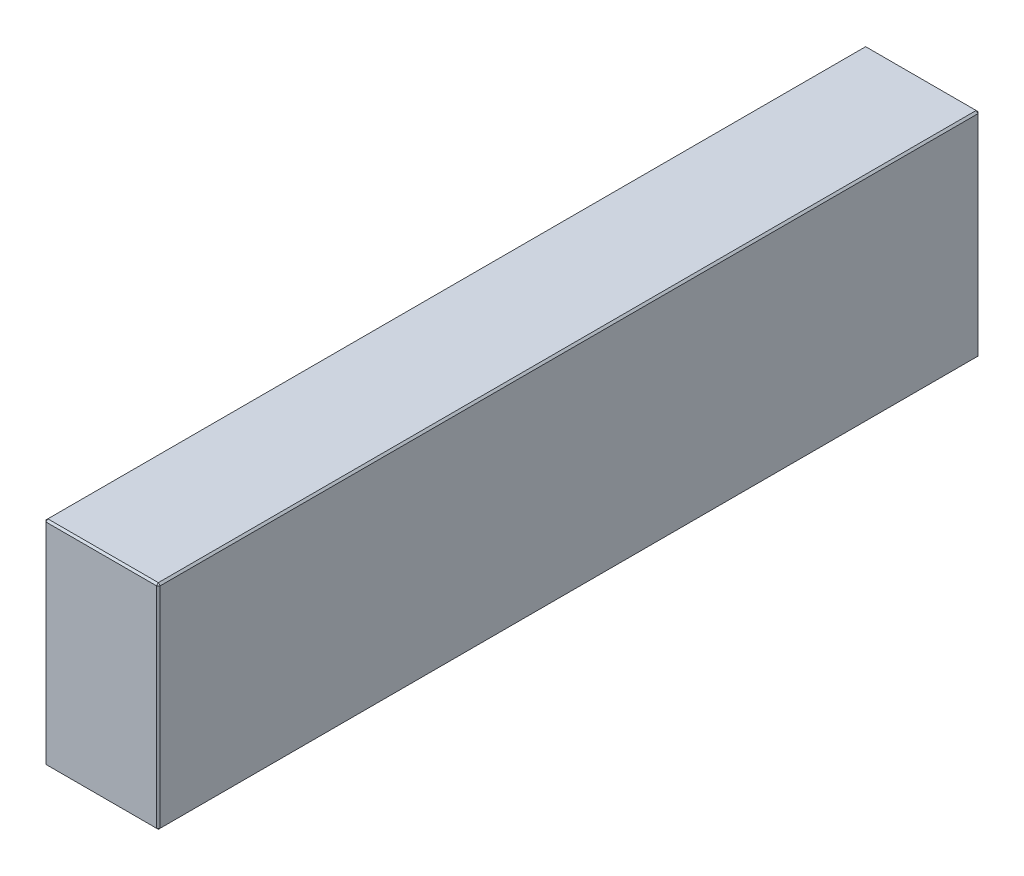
ISO-10303-21;
HEADER;
FILE_DESCRIPTION(('STEP AP214'),'2;1');
FILE_NAME('part.step','',(''),(''),'','','');
FILE_SCHEMA(('AUTOMOTIVE_DESIGN { 1 0 10303 214 1 1 1 1 }'));
ENDSEC;
DATA;
#1=APPLICATION_CONTEXT('core data for automotive mechanical design processes');
#2=APPLICATION_PROTOCOL_DEFINITION('international standard','automotive_design',2000,#1);
#3=PRODUCT_CONTEXT('',#1,'mechanical');
#4=PRODUCT('Part','Part','',(#3));
#5=PRODUCT_RELATED_PRODUCT_CATEGORY('part','',(#4));
#6=PRODUCT_DEFINITION_FORMATION('','',#4);
#7=PRODUCT_DEFINITION_CONTEXT('part definition',#1,'design');
#8=PRODUCT_DEFINITION('design','',#6,#7);
#9=PRODUCT_DEFINITION_SHAPE('','',#8);
#10=(LENGTH_UNIT() NAMED_UNIT(*) SI_UNIT(.MILLI.,.METRE.));
#11=(NAMED_UNIT(*) PLANE_ANGLE_UNIT() SI_UNIT($,.RADIAN.));
#12=(NAMED_UNIT(*) SI_UNIT($,.STERADIAN.) SOLID_ANGLE_UNIT());
#13=UNCERTAINTY_MEASURE_WITH_UNIT(LENGTH_MEASURE(1.E-05),#10,'distance_accuracy_value','');
#14=(GEOMETRIC_REPRESENTATION_CONTEXT(3) GLOBAL_UNCERTAINTY_ASSIGNED_CONTEXT((#13)) GLOBAL_UNIT_ASSIGNED_CONTEXT((#10,
#11,#12)) REPRESENTATION_CONTEXT('',''));
#15=CARTESIAN_POINT('',(0.,0.,0.));
#16=DIRECTION('',(0.,0.,1.));
#17=DIRECTION('',(1.,0.,0.));
#18=AXIS2_PLACEMENT_3D('',#15,#16,#17);
#19=CARTESIAN_POINT('',(-31.,116.,223.));
#20=DIRECTION('',(1.,0.,0.));
#21=DIRECTION('',(0.,0.,-1.));
#22=AXIS2_PLACEMENT_3D('',#19,#20,#21);
#23=PLANE('',#22);
#24=DIRECTION('',(0.,-1.,0.));
#25=VECTOR('',#24,1.);
#26=CARTESIAN_POINT('',(-31.,116.,-222.));
#27=LINE('',#26,#25);
#28=CARTESIAN_POINT('',(-31.,115.,-222.));
#29=VERTEX_POINT('',#28);
#30=CARTESIAN_POINT('',(-31.,1.,-222.));
#31=VERTEX_POINT('',#30);
#32=EDGE_CURVE('E114',#29,#31,#27,.T.);
#33=ORIENTED_EDGE('',*,*,#32,.T.);
#34=DIRECTION('',(0.,0.,1.));
#35=VECTOR('',#34,1.);
#36=CARTESIAN_POINT('',(-31.,1.,223.));
#37=LINE('',#36,#35);
#38=CARTESIAN_POINT('',(-31.,1.,222.));
#39=VERTEX_POINT('',#38);
#40=EDGE_CURVE('E110',#31,#39,#37,.T.);
#41=ORIENTED_EDGE('',*,*,#40,.T.);
#42=DIRECTION('',(0.,1.,0.));
#43=VECTOR('',#42,1.);
#44=CARTESIAN_POINT('',(-31.,116.,222.));
#45=LINE('',#44,#43);
#46=CARTESIAN_POINT('',(-31.,115.,222.));
#47=VERTEX_POINT('',#46);
#48=EDGE_CURVE('E103',#39,#47,#45,.T.);
#49=ORIENTED_EDGE('',*,*,#48,.T.);
#50=DIRECTION('',(0.,0.,-1.));
#51=VECTOR('',#50,1.);
#52=CARTESIAN_POINT('',(-31.,115.,-223.));
#53=LINE('',#52,#51);
#54=EDGE_CURVE('E107',#47,#29,#53,.T.);
#55=ORIENTED_EDGE('',*,*,#54,.T.);
#56=EDGE_LOOP('',(#33,#41,#49,#55));
#57=FACE_BOUND('',#56,.T.);
#58=ADVANCED_FACE('F15',(#57),#23,.F.);
#59=CARTESIAN_POINT('',(31.,116.,223.));
#60=DIRECTION('',(0.,0.,-1.));
#61=DIRECTION('',(-1.,0.,0.));
#62=AXIS2_PLACEMENT_3D('',#59,#60,#61);
#63=PLANE('',#62);
#64=DIRECTION('',(-1.,0.,0.));
#65=VECTOR('',#64,1.);
#66=CARTESIAN_POINT('',(-31.,115.,223.));
#67=LINE('',#66,#65);
#68=CARTESIAN_POINT('',(30.,115.,223.));
#69=VERTEX_POINT('',#68);
#70=CARTESIAN_POINT('',(-30.,115.,223.));
#71=VERTEX_POINT('',#70);
#72=EDGE_CURVE('E164',#69,#71,#67,.T.);
#73=ORIENTED_EDGE('',*,*,#72,.T.);
#74=DIRECTION('',(0.,-1.,0.));
#75=VECTOR('',#74,1.);
#76=CARTESIAN_POINT('',(-30.,116.,223.));
#77=LINE('',#76,#75);
#78=CARTESIAN_POINT('',(-30.,1.00000000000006,223.));
#79=VERTEX_POINT('',#78);
#80=EDGE_CURVE('E122',#71,#79,#77,.T.);
#81=ORIENTED_EDGE('',*,*,#80,.T.);
#82=DIRECTION('',(1.,0.,0.));
#83=VECTOR('',#82,1.);
#84=CARTESIAN_POINT('',(31.,1.00000000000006,223.));
#85=LINE('',#84,#83);
#86=CARTESIAN_POINT('',(30.,1.00000000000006,223.));
#87=VERTEX_POINT('',#86);
#88=EDGE_CURVE('E168',#79,#87,#85,.T.);
#89=ORIENTED_EDGE('',*,*,#88,.T.);
#90=DIRECTION('',(0.,1.,0.));
#91=VECTOR('',#90,1.);
#92=CARTESIAN_POINT('',(30.,116.,223.));
#93=LINE('',#92,#91);
#94=EDGE_CURVE('E166',#87,#69,#93,.T.);
#95=ORIENTED_EDGE('',*,*,#94,.T.);
#96=EDGE_LOOP('',(#73,#81,#89,#95));
#97=FACE_BOUND('',#96,.T.);
#98=ADVANCED_FACE('F275',(#97),#63,.F.);
#99=CARTESIAN_POINT('',(31.,116.,223.));
#100=DIRECTION('',(-1.,0.,0.));
#101=DIRECTION('',(0.,0.,1.));
#102=AXIS2_PLACEMENT_3D('',#99,#100,#101);
#103=PLANE('',#102);
#104=DIRECTION('',(0.,0.,-1.));
#105=VECTOR('',#104,1.);
#106=CARTESIAN_POINT('',(31.,1.00000000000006,223.));
#107=LINE('',#106,#105);
#108=CARTESIAN_POINT('',(31.,1.00000000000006,222.));
#109=VERTEX_POINT('',#108);
#110=CARTESIAN_POINT('',(31.,1.00000000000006,-222.));
#111=VERTEX_POINT('',#110);
#112=EDGE_CURVE('E159',#109,#111,#107,.T.);
#113=ORIENTED_EDGE('',*,*,#112,.T.);
#114=DIRECTION('',(0.,1.,0.));
#115=VECTOR('',#114,1.);
#116=CARTESIAN_POINT('',(31.,116.,-222.));
#117=LINE('',#116,#115);
#118=CARTESIAN_POINT('',(31.,115.,-222.));
#119=VERTEX_POINT('',#118);
#120=EDGE_CURVE('E161',#111,#119,#117,.T.);
#121=ORIENTED_EDGE('',*,*,#120,.T.);
#122=DIRECTION('',(0.,0.,1.));
#123=VECTOR('',#122,1.);
#124=CARTESIAN_POINT('',(31.,115.,223.));
#125=LINE('',#124,#123);
#126=CARTESIAN_POINT('',(31.,115.,222.));
#127=VERTEX_POINT('',#126);
#128=EDGE_CURVE('E155',#119,#127,#125,.T.);
#129=ORIENTED_EDGE('',*,*,#128,.T.);
#130=DIRECTION('',(0.,-1.,0.));
#131=VECTOR('',#130,1.);
#132=CARTESIAN_POINT('',(31.,116.,222.));
#133=LINE('',#132,#131);
#134=EDGE_CURVE('E157',#127,#109,#133,.T.);
#135=ORIENTED_EDGE('',*,*,#134,.T.);
#136=EDGE_LOOP('',(#113,#121,#129,#135));
#137=FACE_BOUND('',#136,.T.);
#138=ADVANCED_FACE('F254',(#137),#103,.F.);
#139=CARTESIAN_POINT('',(31.,116.,-223.));
#140=DIRECTION('',(0.,0.,1.));
#141=DIRECTION('',(1.,0.,0.));
#142=AXIS2_PLACEMENT_3D('',#139,#140,#141);
#143=PLANE('',#142);
#144=DIRECTION('',(0.,-1.,0.));
#145=VECTOR('',#144,1.);
#146=CARTESIAN_POINT('',(30.,116.,-223.));
#147=LINE('',#146,#145);
#148=CARTESIAN_POINT('',(30.,115.,-223.));
#149=VERTEX_POINT('',#148);
#150=CARTESIAN_POINT('',(30.,1.00000000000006,-223.));
#151=VERTEX_POINT('',#150);
#152=EDGE_CURVE('E148',#149,#151,#147,.T.);
#153=ORIENTED_EDGE('',*,*,#152,.T.);
#154=DIRECTION('',(-1.,0.,0.));
#155=VECTOR('',#154,1.);
#156=CARTESIAN_POINT('',(31.,1.00000000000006,-223.));
#157=LINE('',#156,#155);
#158=CARTESIAN_POINT('',(-30.,1.00000000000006,-223.));
#159=VERTEX_POINT('',#158);
#160=EDGE_CURVE('E153',#151,#159,#157,.T.);
#161=ORIENTED_EDGE('',*,*,#160,.T.);
#162=DIRECTION('',(0.,1.,0.));
#163=VECTOR('',#162,1.);
#164=CARTESIAN_POINT('',(-30.,116.,-223.));
#165=LINE('',#164,#163);
#166=CARTESIAN_POINT('',(-30.,115.,-223.));
#167=VERTEX_POINT('',#166);
#168=EDGE_CURVE('E150',#159,#167,#165,.T.);
#169=ORIENTED_EDGE('',*,*,#168,.T.);
#170=DIRECTION('',(1.,0.,0.));
#171=VECTOR('',#170,1.);
#172=CARTESIAN_POINT('',(31.,115.,-223.));
#173=LINE('',#172,#171);
#174=EDGE_CURVE('E146',#167,#149,#173,.T.);
#175=ORIENTED_EDGE('',*,*,#174,.T.);
#176=EDGE_LOOP('',(#153,#161,#169,#175));
#177=FACE_BOUND('',#176,.T.);
#178=ADVANCED_FACE('F284',(#177),#143,.F.);
#179=CARTESIAN_POINT('',(0.,116.,0.));
#180=DIRECTION('',(0.,1.,0.));
#181=DIRECTION('',(0.,0.,1.));
#182=AXIS2_PLACEMENT_3D('',#179,#180,#181);
#183=PLANE('',#182);
#184=DIRECTION('',(0.,0.,-1.));
#185=VECTOR('',#184,1.);
#186=CARTESIAN_POINT('',(30.,116.,-223.));
#187=LINE('',#186,#185);
#188=CARTESIAN_POINT('',(30.,116.,222.));
#189=VERTEX_POINT('',#188);
#190=CARTESIAN_POINT('',(30.,116.,-222.));
#191=VERTEX_POINT('',#190);
#192=EDGE_CURVE('E24',#189,#191,#187,.T.);
#193=ORIENTED_EDGE('',*,*,#192,.T.);
#194=DIRECTION('',(-1.,0.,0.));
#195=VECTOR('',#194,1.);
#196=CARTESIAN_POINT('',(-31.,116.,-222.));
#197=LINE('',#196,#195);
#198=CARTESIAN_POINT('',(-30.,116.,-222.));
#199=VERTEX_POINT('',#198);
#200=EDGE_CURVE('E9',#191,#199,#197,.T.);
#201=ORIENTED_EDGE('',*,*,#200,.T.);
#202=DIRECTION('',(0.,0.,1.));
#203=VECTOR('',#202,1.);
#204=CARTESIAN_POINT('',(-30.,116.,223.));
#205=LINE('',#204,#203);
#206=CARTESIAN_POINT('',(-30.,116.,222.));
#207=VERTEX_POINT('',#206);
#208=EDGE_CURVE('E180',#199,#207,#205,.T.);
#209=ORIENTED_EDGE('',*,*,#208,.T.);
#210=DIRECTION('',(1.,0.,0.));
#211=VECTOR('',#210,1.);
#212=CARTESIAN_POINT('',(31.,116.,222.));
#213=LINE('',#212,#211);
#214=EDGE_CURVE('E35',#207,#189,#213,.T.);
#215=ORIENTED_EDGE('',*,*,#214,.T.);
#216=EDGE_LOOP('',(#193,#201,#209,#215));
#217=FACE_BOUND('',#216,.T.);
#218=ADVANCED_FACE('F350',(#217),#183,.T.);
#219=CARTESIAN_POINT('',(0.,0.,0.));
#220=DIRECTION('',(0.,1.,0.));
#221=DIRECTION('',(0.,0.,1.));
#222=AXIS2_PLACEMENT_3D('',#219,#220,#221);
#223=PLANE('',#222);
#224=DIRECTION('',(0.,0.,1.));
#225=VECTOR('',#224,1.);
#226=CARTESIAN_POINT('',(30.,0.,0.));
#227=LINE('',#226,#225);
#228=CARTESIAN_POINT('',(30.,0.,-222.));
#229=VERTEX_POINT('',#228);
#230=CARTESIAN_POINT('',(30.,0.,222.));
#231=VERTEX_POINT('',#230);
#232=EDGE_CURVE('E171',#229,#231,#227,.T.);
#233=ORIENTED_EDGE('',*,*,#232,.T.);
#234=DIRECTION('',(-1.,0.,0.));
#235=VECTOR('',#234,1.);
#236=CARTESIAN_POINT('',(0.,0.,222.));
#237=LINE('',#236,#235);
#238=CARTESIAN_POINT('',(-30.,0.,222.));
#239=VERTEX_POINT('',#238);
#240=EDGE_CURVE('E177',#231,#239,#237,.T.);
#241=ORIENTED_EDGE('',*,*,#240,.T.);
#242=DIRECTION('',(0.,0.,-1.));
#243=VECTOR('',#242,1.);
#244=CARTESIAN_POINT('',(-30.,0.,0.));
#245=LINE('',#244,#243);
#246=CARTESIAN_POINT('',(-30.,0.,-222.));
#247=VERTEX_POINT('',#246);
#248=EDGE_CURVE('E175',#239,#247,#245,.T.);
#249=ORIENTED_EDGE('',*,*,#248,.T.);
#250=DIRECTION('',(1.,0.,0.));
#251=VECTOR('',#250,1.);
#252=CARTESIAN_POINT('',(0.,0.,-222.));
#253=LINE('',#252,#251);
#254=EDGE_CURVE('E173',#247,#229,#253,.T.);
#255=ORIENTED_EDGE('',*,*,#254,.T.);
#256=EDGE_LOOP('',(#233,#241,#249,#255));
#257=FACE_BOUND('',#256,.T.);
#258=ADVANCED_FACE('F246',(#257),#223,.F.);
#259=CARTESIAN_POINT('',(31.,116.,222.));
#260=DIRECTION('',(-0.707106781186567,0.,-0.707106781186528));
#261=DIRECTION('',(0.,-1.,0.));
#262=AXIS2_PLACEMENT_3D('',#259,#260,#261);
#263=PLANE('',#262);
#264=DIRECTION('',(-0.707106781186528,0.,0.707106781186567));
#265=VECTOR('',#264,1.);
#266=CARTESIAN_POINT('',(30.,115.,223.));
#267=LINE('',#266,#265);
#268=EDGE_CURVE('E19',#69,#127,#267,.F.);
#269=ORIENTED_EDGE('',*,*,#268,.F.);
#270=ORIENTED_EDGE('',*,*,#94,.F.);
#271=DIRECTION('',(0.707106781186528,0.,-0.707106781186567));
#272=VECTOR('',#271,1.);
#273=CARTESIAN_POINT('',(30.,1.00000000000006,223.));
#274=LINE('',#273,#272);
#275=EDGE_CURVE('E142',#109,#87,#274,.F.);
#276=ORIENTED_EDGE('',*,*,#275,.F.);
#277=ORIENTED_EDGE('',*,*,#134,.F.);
#278=EDGE_LOOP('',(#269,#270,#276,#277));
#279=FACE_BOUND('',#278,.T.);
#280=ADVANCED_FACE('F17',(#279),#263,.F.);
#281=CARTESIAN_POINT('',(30.,115.,223.));
#282=DIRECTION('',(0.577350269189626,0.577350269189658,0.577350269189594));
#283=DIRECTION('',(-0.707106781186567,0.707106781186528,0.));
#284=AXIS2_PLACEMENT_3D('',#281,#282,#283);
#285=PLANE('',#284);
#286=DIRECTION('',(0.,-0.707106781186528,0.707106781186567));
#287=VECTOR('',#286,1.);
#288=CARTESIAN_POINT('',(30.,115.,223.));
#289=LINE('',#288,#287);
#290=EDGE_CURVE('E226',#69,#189,#289,.F.);
#291=ORIENTED_EDGE('',*,*,#290,.F.);
#292=ORIENTED_EDGE('',*,*,#268,.T.);
#293=DIRECTION('',(-0.707106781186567,0.707106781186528,0.));
#294=VECTOR('',#293,1.);
#295=CARTESIAN_POINT('',(30.5,115.5,222.));
#296=LINE('',#295,#294);
#297=EDGE_CURVE('E228',#189,#127,#296,.F.);
#298=ORIENTED_EDGE('',*,*,#297,.F.);
#299=EDGE_LOOP('',(#291,#292,#298));
#300=FACE_BOUND('',#299,.T.);
#301=ADVANCED_FACE('F270',(#300),#285,.T.);
#302=CARTESIAN_POINT('',(30.,1.00000000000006,223.));
#303=DIRECTION('',(0.577350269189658,-0.577350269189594,0.577350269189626));
#304=DIRECTION('',(0.707106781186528,0.,-0.707106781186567));
#305=AXIS2_PLACEMENT_3D('',#302,#303,#304);
#306=PLANE('',#305);
#307=DIRECTION('',(-0.707106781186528,-0.707106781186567,0.));
#308=VECTOR('',#307,1.);
#309=CARTESIAN_POINT('',(30.5,0.500000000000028,222.));
#310=LINE('',#309,#308);
#311=EDGE_CURVE('E220',#109,#231,#310,.T.);
#312=ORIENTED_EDGE('',*,*,#311,.F.);
#313=ORIENTED_EDGE('',*,*,#275,.T.);
#314=DIRECTION('',(0.,0.707106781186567,0.707106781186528));
#315=VECTOR('',#314,1.);
#316=CARTESIAN_POINT('',(30.,1.00000000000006,223.));
#317=LINE('',#316,#315);
#318=EDGE_CURVE('E223',#231,#87,#317,.T.);
#319=ORIENTED_EDGE('',*,*,#318,.F.);
#320=EDGE_LOOP('',(#312,#313,#319));
#321=FACE_BOUND('',#320,.T.);
#322=ADVANCED_FACE('F235',(#321),#306,.T.);
#323=CARTESIAN_POINT('',(30.,116.,0.));
#324=DIRECTION('',(0.707106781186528,0.707106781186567,0.));
#325=DIRECTION('',(0.,0.,1.));
#326=AXIS2_PLACEMENT_3D('',#323,#324,#325);
#327=PLANE('',#326);
#328=ORIENTED_EDGE('',*,*,#297,.T.);
#329=ORIENTED_EDGE('',*,*,#128,.F.);
#330=DIRECTION('',(0.707106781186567,-0.707106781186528,0.));
#331=VECTOR('',#330,1.);
#332=CARTESIAN_POINT('',(31.,115.,-222.));
#333=LINE('',#332,#331);
#334=EDGE_CURVE('E215',#191,#119,#333,.T.);
#335=ORIENTED_EDGE('',*,*,#334,.F.);
#336=ORIENTED_EDGE('',*,*,#192,.F.);
#337=EDGE_LOOP('',(#328,#329,#335,#336));
#338=FACE_BOUND('',#337,.T.);
#339=ADVANCED_FACE('F265',(#338),#327,.T.);
#340=CARTESIAN_POINT('',(0.,116.,222.));
#341=DIRECTION('',(0.,0.707106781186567,0.707106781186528));
#342=DIRECTION('',(-1.,0.,0.));
#343=AXIS2_PLACEMENT_3D('',#340,#341,#342);
#344=PLANE('',#343);
#345=ORIENTED_EDGE('',*,*,#290,.T.);
#346=ORIENTED_EDGE('',*,*,#214,.F.);
#347=DIRECTION('',(0.,0.707106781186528,-0.707106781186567));
#348=VECTOR('',#347,1.);
#349=CARTESIAN_POINT('',(-30.,115.5,222.5));
#350=LINE('',#349,#348);
#351=EDGE_CURVE('E126',#71,#207,#350,.T.);
#352=ORIENTED_EDGE('',*,*,#351,.F.);
#353=ORIENTED_EDGE('',*,*,#72,.F.);
#354=EDGE_LOOP('',(#345,#346,#352,#353));
#355=FACE_BOUND('',#354,.T.);
#356=ADVANCED_FACE('F273',(#355),#344,.T.);
#357=CARTESIAN_POINT('',(-30.,116.,223.));
#358=DIRECTION('',(0.707106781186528,0.,-0.707106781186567));
#359=DIRECTION('',(0.,-1.,0.));
#360=AXIS2_PLACEMENT_3D('',#357,#358,#359);
#361=PLANE('',#360);
#362=DIRECTION('',(0.707106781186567,0.,0.707106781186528));
#363=VECTOR('',#362,1.);
#364=CARTESIAN_POINT('',(-30.,1.00000000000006,223.));
#365=LINE('',#364,#363);
#366=EDGE_CURVE('E127',#79,#39,#365,.F.);
#367=ORIENTED_EDGE('',*,*,#366,.F.);
#368=ORIENTED_EDGE('',*,*,#80,.F.);
#369=DIRECTION('',(-0.707106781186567,0.,-0.707106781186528));
#370=VECTOR('',#369,1.);
#371=CARTESIAN_POINT('',(-31.,115.,222.));
#372=LINE('',#371,#370);
#373=EDGE_CURVE('E118',#47,#71,#372,.F.);
#374=ORIENTED_EDGE('',*,*,#373,.F.);
#375=ORIENTED_EDGE('',*,*,#48,.F.);
#376=EDGE_LOOP('',(#367,#368,#374,#375));
#377=FACE_BOUND('',#376,.T.);
#378=ADVANCED_FACE('F120',(#377),#361,.F.);
#379=CARTESIAN_POINT('',(31.,1.00000000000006,223.));
#380=DIRECTION('',(0.,0.707106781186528,-0.707106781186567));
#381=DIRECTION('',(1.,0.,0.));
#382=AXIS2_PLACEMENT_3D('',#379,#380,#381);
#383=PLANE('',#382);
#384=ORIENTED_EDGE('',*,*,#318,.T.);
#385=ORIENTED_EDGE('',*,*,#88,.F.);
#386=DIRECTION('',(0.,-0.707106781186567,-0.707106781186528));
#387=VECTOR('',#386,1.);
#388=CARTESIAN_POINT('',(-30.,1.00000000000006,223.));
#389=LINE('',#388,#387);
#390=EDGE_CURVE('E211',#239,#79,#389,.F.);
#391=ORIENTED_EDGE('',*,*,#390,.F.);
#392=ORIENTED_EDGE('',*,*,#240,.F.);
#393=EDGE_LOOP('',(#384,#385,#391,#392));
#394=FACE_BOUND('',#393,.T.);
#395=ADVANCED_FACE('F243',(#394),#383,.F.);
#396=CARTESIAN_POINT('',(31.,1.00000000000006,223.));
#397=DIRECTION('',(-0.707106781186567,0.707106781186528,0.));
#398=DIRECTION('',(0.,0.,-1.));
#399=AXIS2_PLACEMENT_3D('',#396,#397,#398);
#400=PLANE('',#399);
#401=ORIENTED_EDGE('',*,*,#311,.T.);
#402=ORIENTED_EDGE('',*,*,#232,.F.);
#403=DIRECTION('',(0.707106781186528,0.707106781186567,0.));
#404=VECTOR('',#403,1.);
#405=CARTESIAN_POINT('',(30.5,0.500000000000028,-222.));
#406=LINE('',#405,#404);
#407=EDGE_CURVE('E208',#111,#229,#406,.F.);
#408=ORIENTED_EDGE('',*,*,#407,.F.);
#409=ORIENTED_EDGE('',*,*,#112,.F.);
#410=EDGE_LOOP('',(#401,#402,#408,#409));
#411=FACE_BOUND('',#410,.T.);
#412=ADVANCED_FACE('F251',(#411),#400,.F.);
#413=CARTESIAN_POINT('',(30.,116.,-223.));
#414=DIRECTION('',(-0.707106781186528,0.,0.707106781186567));
#415=DIRECTION('',(0.,-1.,0.));
#416=AXIS2_PLACEMENT_3D('',#413,#414,#415);
#417=PLANE('',#416);
#418=DIRECTION('',(0.707106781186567,0.,0.707106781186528));
#419=VECTOR('',#418,1.);
#420=CARTESIAN_POINT('',(31.,115.,-222.));
#421=LINE('',#420,#419);
#422=EDGE_CURVE('E217',#119,#149,#421,.F.);
#423=ORIENTED_EDGE('',*,*,#422,.F.);
#424=ORIENTED_EDGE('',*,*,#120,.F.);
#425=DIRECTION('',(-0.707106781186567,0.,-0.707106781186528));
#426=VECTOR('',#425,1.);
#427=CARTESIAN_POINT('',(30.,1.00000000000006,-223.));
#428=LINE('',#427,#426);
#429=EDGE_CURVE('E205',#151,#111,#428,.F.);
#430=ORIENTED_EDGE('',*,*,#429,.F.);
#431=ORIENTED_EDGE('',*,*,#152,.F.);
#432=EDGE_LOOP('',(#423,#424,#430,#431));
#433=FACE_BOUND('',#432,.T.);
#434=ADVANCED_FACE('F258',(#433),#417,.F.);
#435=CARTESIAN_POINT('',(31.,115.,-222.));
#436=DIRECTION('',(0.577350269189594,0.577350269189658,-0.577350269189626));
#437=DIRECTION('',(0.,0.707106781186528,0.707106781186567));
#438=AXIS2_PLACEMENT_3D('',#435,#436,#437);
#439=PLANE('',#438);
#440=ORIENTED_EDGE('',*,*,#334,.T.);
#441=ORIENTED_EDGE('',*,*,#422,.T.);
#442=DIRECTION('',(0.,0.707106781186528,0.707106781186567));
#443=VECTOR('',#442,1.);
#444=CARTESIAN_POINT('',(30.,115.5,-222.5));
#445=LINE('',#444,#443);
#446=EDGE_CURVE('E134',#191,#149,#445,.F.);
#447=ORIENTED_EDGE('',*,*,#446,.F.);
#448=EDGE_LOOP('',(#440,#441,#447));
#449=FACE_BOUND('',#448,.T.);
#450=ADVANCED_FACE('F325',(#449),#439,.T.);
#451=CARTESIAN_POINT('',(-31.,115.,222.));
#452=DIRECTION('',(-0.577350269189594,0.577350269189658,0.577350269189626));
#453=DIRECTION('',(0.,-0.707106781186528,0.707106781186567));
#454=AXIS2_PLACEMENT_3D('',#451,#452,#453);
#455=PLANE('',#454);
#456=ORIENTED_EDGE('',*,*,#373,.T.);
#457=ORIENTED_EDGE('',*,*,#351,.T.);
#458=DIRECTION('',(-0.707106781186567,-0.707106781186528,0.));
#459=VECTOR('',#458,1.);
#460=CARTESIAN_POINT('',(-31.,115.,222.));
#461=LINE('',#460,#459);
#462=EDGE_CURVE('E130',#47,#207,#461,.F.);
#463=ORIENTED_EDGE('',*,*,#462,.F.);
#464=EDGE_LOOP('',(#456,#457,#463));
#465=FACE_BOUND('',#464,.T.);
#466=ADVANCED_FACE('F131',(#465),#455,.T.);
#467=CARTESIAN_POINT('',(-30.,1.00000000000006,223.));
#468=DIRECTION('',(-0.577350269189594,-0.577350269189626,0.577350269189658));
#469=DIRECTION('',(0.,-0.707106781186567,-0.707106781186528));
#470=AXIS2_PLACEMENT_3D('',#467,#468,#469);
#471=PLANE('',#470);
#472=ORIENTED_EDGE('',*,*,#390,.T.);
#473=ORIENTED_EDGE('',*,*,#366,.T.);
#474=DIRECTION('',(-0.707106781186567,0.707106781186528,0.));
#475=VECTOR('',#474,1.);
#476=CARTESIAN_POINT('',(-30.5,0.5,222.));
#477=LINE('',#476,#475);
#478=EDGE_CURVE('E135',#239,#39,#477,.T.);
#479=ORIENTED_EDGE('',*,*,#478,.F.);
#480=EDGE_LOOP('',(#472,#473,#479));
#481=FACE_BOUND('',#480,.T.);
#482=ADVANCED_FACE('F318',(#481),#471,.T.);
#483=CARTESIAN_POINT('',(30.,1.00000000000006,-223.));
#484=DIRECTION('',(0.577350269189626,-0.577350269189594,-0.577350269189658));
#485=DIRECTION('',(-0.707106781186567,0.,-0.707106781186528));
#486=AXIS2_PLACEMENT_3D('',#483,#484,#485);
#487=PLANE('',#486);
#488=ORIENTED_EDGE('',*,*,#429,.T.);
#489=ORIENTED_EDGE('',*,*,#407,.T.);
#490=DIRECTION('',(0.,-0.707106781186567,0.707106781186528));
#491=VECTOR('',#490,1.);
#492=CARTESIAN_POINT('',(30.,1.00000000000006,-223.));
#493=LINE('',#492,#491);
#494=EDGE_CURVE('E198',#151,#229,#493,.T.);
#495=ORIENTED_EDGE('',*,*,#494,.F.);
#496=EDGE_LOOP('',(#488,#489,#495));
#497=FACE_BOUND('',#496,.T.);
#498=ADVANCED_FACE('F314',(#497),#487,.T.);
#499=CARTESIAN_POINT('',(0.,116.,-222.));
#500=DIRECTION('',(0.,0.707106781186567,-0.707106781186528));
#501=DIRECTION('',(1.,0.,0.));
#502=AXIS2_PLACEMENT_3D('',#499,#500,#501);
#503=PLANE('',#502);
#504=ORIENTED_EDGE('',*,*,#446,.T.);
#505=ORIENTED_EDGE('',*,*,#174,.F.);
#506=DIRECTION('',(0.,-0.707106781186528,-0.707106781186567));
#507=VECTOR('',#506,1.);
#508=CARTESIAN_POINT('',(-30.,115.,-223.));
#509=LINE('',#508,#507);
#510=EDGE_CURVE('E195',#199,#167,#509,.T.);
#511=ORIENTED_EDGE('',*,*,#510,.F.);
#512=ORIENTED_EDGE('',*,*,#200,.F.);
#513=EDGE_LOOP('',(#504,#505,#511,#512));
#514=FACE_BOUND('',#513,.T.);
#515=ADVANCED_FACE('F311',(#514),#503,.T.);
#516=CARTESIAN_POINT('',(-30.,116.,0.));
#517=DIRECTION('',(-0.707106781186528,0.707106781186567,0.));
#518=DIRECTION('',(0.,0.,-1.));
#519=AXIS2_PLACEMENT_3D('',#516,#517,#518);
#520=PLANE('',#519);
#521=ORIENTED_EDGE('',*,*,#462,.T.);
#522=ORIENTED_EDGE('',*,*,#208,.F.);
#523=DIRECTION('',(0.707106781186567,0.707106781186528,0.));
#524=VECTOR('',#523,1.);
#525=CARTESIAN_POINT('',(-30.5,115.5,-222.));
#526=LINE('',#525,#524);
#527=EDGE_CURVE('E138',#29,#199,#526,.T.);
#528=ORIENTED_EDGE('',*,*,#527,.F.);
#529=ORIENTED_EDGE('',*,*,#54,.F.);
#530=EDGE_LOOP('',(#521,#522,#528,#529));
#531=FACE_BOUND('',#530,.T.);
#532=ADVANCED_FACE('F137',(#531),#520,.T.);
#533=CARTESIAN_POINT('',(-31.,1.,223.));
#534=DIRECTION('',(0.707106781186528,0.707106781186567,0.));
#535=DIRECTION('',(0.,0.,1.));
#536=AXIS2_PLACEMENT_3D('',#533,#534,#535);
#537=PLANE('',#536);
#538=ORIENTED_EDGE('',*,*,#478,.T.);
#539=ORIENTED_EDGE('',*,*,#40,.F.);
#540=DIRECTION('',(0.707106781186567,-0.707106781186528,0.));
#541=VECTOR('',#540,1.);
#542=CARTESIAN_POINT('',(-31.,1.,-222.));
#543=LINE('',#542,#541);
#544=EDGE_CURVE('E191',#247,#31,#543,.F.);
#545=ORIENTED_EDGE('',*,*,#544,.F.);
#546=ORIENTED_EDGE('',*,*,#248,.F.);
#547=EDGE_LOOP('',(#538,#539,#545,#546));
#548=FACE_BOUND('',#547,.T.);
#549=ADVANCED_FACE('F304',(#548),#537,.F.);
#550=CARTESIAN_POINT('',(31.,1.00000000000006,-223.));
#551=DIRECTION('',(0.,0.707106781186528,0.707106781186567));
#552=DIRECTION('',(-1.,0.,0.));
#553=AXIS2_PLACEMENT_3D('',#550,#551,#552);
#554=PLANE('',#553);
#555=ORIENTED_EDGE('',*,*,#494,.T.);
#556=ORIENTED_EDGE('',*,*,#254,.F.);
#557=DIRECTION('',(0.,0.707106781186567,-0.707106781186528));
#558=VECTOR('',#557,1.);
#559=CARTESIAN_POINT('',(-30.,0.500000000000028,-222.5));
#560=LINE('',#559,#558);
#561=EDGE_CURVE('E188',#159,#247,#560,.F.);
#562=ORIENTED_EDGE('',*,*,#561,.F.);
#563=ORIENTED_EDGE('',*,*,#160,.F.);
#564=EDGE_LOOP('',(#555,#556,#562,#563));
#565=FACE_BOUND('',#564,.T.);
#566=ADVANCED_FACE('F300',(#565),#554,.F.);
#567=CARTESIAN_POINT('',(-30.,115.,-223.));
#568=DIRECTION('',(-0.577350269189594,0.577350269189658,-0.577350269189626));
#569=DIRECTION('',(0.,0.707106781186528,0.707106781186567));
#570=AXIS2_PLACEMENT_3D('',#567,#568,#569);
#571=PLANE('',#570);
#572=ORIENTED_EDGE('',*,*,#527,.T.);
#573=ORIENTED_EDGE('',*,*,#510,.T.);
#574=DIRECTION('',(0.707106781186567,0.,-0.707106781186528));
#575=VECTOR('',#574,1.);
#576=CARTESIAN_POINT('',(-30.,115.,-223.));
#577=LINE('',#576,#575);
#578=EDGE_CURVE('E186',#29,#167,#577,.T.);
#579=ORIENTED_EDGE('',*,*,#578,.F.);
#580=EDGE_LOOP('',(#572,#573,#579));
#581=FACE_BOUND('',#580,.T.);
#582=ADVANCED_FACE('F296',(#581),#571,.T.);
#583=CARTESIAN_POINT('',(-31.,1.,-222.));
#584=DIRECTION('',(-0.577350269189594,-0.577350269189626,-0.577350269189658));
#585=DIRECTION('',(0.,0.707106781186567,-0.707106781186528));
#586=AXIS2_PLACEMENT_3D('',#583,#584,#585);
#587=PLANE('',#586);
#588=ORIENTED_EDGE('',*,*,#561,.T.);
#589=ORIENTED_EDGE('',*,*,#544,.T.);
#590=DIRECTION('',(-0.707106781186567,0.,0.707106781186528));
#591=VECTOR('',#590,1.);
#592=CARTESIAN_POINT('',(-31.,1.,-222.));
#593=LINE('',#592,#591);
#594=EDGE_CURVE('E184',#159,#31,#593,.T.);
#595=ORIENTED_EDGE('',*,*,#594,.F.);
#596=EDGE_LOOP('',(#588,#589,#595));
#597=FACE_BOUND('',#596,.T.);
#598=ADVANCED_FACE('F292',(#597),#587,.T.);
#599=CARTESIAN_POINT('',(-31.,116.,-222.));
#600=DIRECTION('',(0.707106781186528,0.,0.707106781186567));
#601=DIRECTION('',(0.,-1.,0.));
#602=AXIS2_PLACEMENT_3D('',#599,#600,#601);
#603=PLANE('',#602);
#604=ORIENTED_EDGE('',*,*,#578,.T.);
#605=ORIENTED_EDGE('',*,*,#168,.F.);
#606=ORIENTED_EDGE('',*,*,#594,.T.);
#607=ORIENTED_EDGE('',*,*,#32,.F.);
#608=EDGE_LOOP('',(#604,#605,#606,#607));
#609=FACE_BOUND('',#608,.T.);
#610=ADVANCED_FACE('F289',(#609),#603,.F.);
#611=CLOSED_SHELL('',(#58,#98,#138,#178,#218,#258,#280,#301,#322,#339,#356,#378,#395,#412,#434,
#450,#466,#482,#498,#515,#532,#549,#566,#582,#598,#610));
#612=MANIFOLD_SOLID_BREP('B1',#611);
#613=ADVANCED_BREP_SHAPE_REPRESENTATION('',(#18,#612),#14);
#614=SHAPE_DEFINITION_REPRESENTATION(#9,#613);
ENDSEC;
END-ISO-10303-21;
